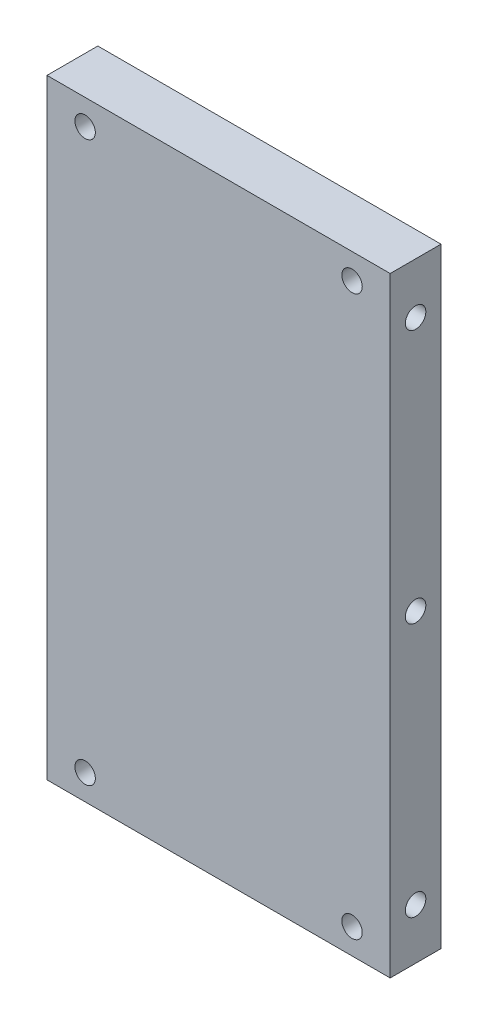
ISO-10303-21;
HEADER;
FILE_DESCRIPTION(('STEP AP214'),'2;1');
FILE_NAME('part.step','',(''),(''),'','','');
FILE_SCHEMA(('AUTOMOTIVE_DESIGN { 1 0 10303 214 1 1 1 1 }'));
ENDSEC;
DATA;
#1=APPLICATION_CONTEXT('core data for automotive mechanical design processes');
#2=APPLICATION_PROTOCOL_DEFINITION('international standard','automotive_design',2000,#1);
#3=PRODUCT_CONTEXT('',#1,'mechanical');
#4=PRODUCT('Part','Part','',(#3));
#5=PRODUCT_RELATED_PRODUCT_CATEGORY('part','',(#4));
#6=PRODUCT_DEFINITION_FORMATION('','',#4);
#7=PRODUCT_DEFINITION_CONTEXT('part definition',#1,'design');
#8=PRODUCT_DEFINITION('design','',#6,#7);
#9=PRODUCT_DEFINITION_SHAPE('','',#8);
#10=(LENGTH_UNIT() NAMED_UNIT(*) SI_UNIT(.MILLI.,.METRE.));
#11=(NAMED_UNIT(*) PLANE_ANGLE_UNIT() SI_UNIT($,.RADIAN.));
#12=(NAMED_UNIT(*) SI_UNIT($,.STERADIAN.) SOLID_ANGLE_UNIT());
#13=UNCERTAINTY_MEASURE_WITH_UNIT(LENGTH_MEASURE(1.E-05),#10,'distance_accuracy_value','');
#14=(GEOMETRIC_REPRESENTATION_CONTEXT(3) GLOBAL_UNCERTAINTY_ASSIGNED_CONTEXT((#13)) GLOBAL_UNIT_ASSIGNED_CONTEXT((#10,
#11,#12)) REPRESENTATION_CONTEXT('',''));
#15=CARTESIAN_POINT('',(0.,0.,0.));
#16=DIRECTION('',(0.,0.,1.));
#17=DIRECTION('',(1.,0.,0.));
#18=AXIS2_PLACEMENT_3D('',#15,#16,#17);
#19=CARTESIAN_POINT('',(0.,152.4,0.));
#20=DIRECTION('',(0.,0.,-1.));
#21=DIRECTION('',(-1.,0.,0.));
#22=AXIS2_PLACEMENT_3D('',#19,#20,#21);
#23=PLANE('',#22);
#24=CARTESIAN_POINT('',(9.525,6.34999999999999,0.));
#25=DIRECTION('',(0.,0.,1.));
#26=DIRECTION('',(1.,0.,0.));
#27=AXIS2_PLACEMENT_3D('',#24,#25,#26);
#28=CIRCLE('',#27,2.5527);
#29=CARTESIAN_POINT('',(12.0777,6.34999999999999,0.));
#30=VERTEX_POINT('',#29);
#31=EDGE_CURVE('E139',#30,#30,#28,.T.);
#32=ORIENTED_EDGE('',*,*,#31,.T.);
#33=EDGE_LOOP('',(#32));
#34=FACE_BOUND('',#33,.T.);
#35=CARTESIAN_POINT('',(76.2,146.05,0.));
#36=DIRECTION('',(0.,0.,1.));
#37=DIRECTION('',(1.,0.,0.));
#38=AXIS2_PLACEMENT_3D('',#35,#36,#37);
#39=CIRCLE('',#38,2.55269999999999);
#40=CARTESIAN_POINT('',(78.7527,146.05,0.));
#41=VERTEX_POINT('',#40);
#42=EDGE_CURVE('E157',#41,#41,#39,.T.);
#43=ORIENTED_EDGE('',*,*,#42,.T.);
#44=EDGE_LOOP('',(#43));
#45=FACE_BOUND('',#44,.T.);
#46=DIRECTION('',(0.,-1.,0.));
#47=VECTOR('',#46,1.);
#48=CARTESIAN_POINT('',(0.,0.,0.));
#49=LINE('',#48,#47);
#50=CARTESIAN_POINT('',(0.,152.4,0.));
#51=VERTEX_POINT('',#50);
#52=CARTESIAN_POINT('',(0.,0.,0.));
#53=VERTEX_POINT('',#52);
#54=EDGE_CURVE('E163',#51,#53,#49,.T.);
#55=ORIENTED_EDGE('',*,*,#54,.F.);
#56=DIRECTION('',(-1.,0.,0.));
#57=VECTOR('',#56,1.);
#58=CARTESIAN_POINT('',(0.,152.4,0.));
#59=LINE('',#58,#57);
#60=CARTESIAN_POINT('',(85.725,152.4,0.));
#61=VERTEX_POINT('',#60);
#62=EDGE_CURVE('E170',#61,#51,#59,.T.);
#63=ORIENTED_EDGE('',*,*,#62,.F.);
#64=DIRECTION('',(0.,1.,0.));
#65=VECTOR('',#64,1.);
#66=CARTESIAN_POINT('',(85.725,0.,0.));
#67=LINE('',#66,#65);
#68=CARTESIAN_POINT('',(85.725,0.,0.));
#69=VERTEX_POINT('',#68);
#70=EDGE_CURVE('E168',#69,#61,#67,.T.);
#71=ORIENTED_EDGE('',*,*,#70,.F.);
#72=DIRECTION('',(1.,0.,0.));
#73=VECTOR('',#72,1.);
#74=CARTESIAN_POINT('',(0.,0.,0.));
#75=LINE('',#74,#73);
#76=EDGE_CURVE('E166',#53,#69,#75,.T.);
#77=ORIENTED_EDGE('',*,*,#76,.F.);
#78=EDGE_LOOP('',(#55,#63,#71,#77));
#79=FACE_BOUND('',#78,.T.);
#80=CARTESIAN_POINT('',(9.525,146.05,0.));
#81=DIRECTION('',(0.,0.,1.));
#82=DIRECTION('',(1.,0.,0.));
#83=AXIS2_PLACEMENT_3D('',#80,#81,#82);
#84=CIRCLE('',#83,2.5527);
#85=CARTESIAN_POINT('',(12.0777,146.05,0.));
#86=VERTEX_POINT('',#85);
#87=EDGE_CURVE('E151',#86,#86,#84,.T.);
#88=ORIENTED_EDGE('',*,*,#87,.T.);
#89=EDGE_LOOP('',(#88));
#90=FACE_BOUND('',#89,.T.);
#91=CARTESIAN_POINT('',(76.2,6.34999999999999,0.));
#92=DIRECTION('',(0.,0.,1.));
#93=DIRECTION('',(1.,0.,0.));
#94=AXIS2_PLACEMENT_3D('',#91,#92,#93);
#95=CIRCLE('',#94,2.55269999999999);
#96=CARTESIAN_POINT('',(78.7527,6.34999999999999,0.));
#97=VERTEX_POINT('',#96);
#98=EDGE_CURVE('E145',#97,#97,#95,.T.);
#99=ORIENTED_EDGE('',*,*,#98,.T.);
#100=EDGE_LOOP('',(#99));
#101=FACE_BOUND('',#100,.T.);
#102=ADVANCED_FACE('F38',(#34,#45,#79,#90,#101),#23,.T.);
#103=CARTESIAN_POINT('',(0.,0.,12.7));
#104=DIRECTION('',(1.,0.,0.));
#105=DIRECTION('',(0.,0.,-1.));
#106=AXIS2_PLACEMENT_3D('',#103,#104,#105);
#107=PLANE('',#106);
#108=CARTESIAN_POINT('',(0.,139.7,6.35));
#109=DIRECTION('',(-1.,0.,0.));
#110=DIRECTION('',(0.,0.,1.));
#111=AXIS2_PLACEMENT_3D('',#108,#109,#110);
#112=CIRCLE('',#111,2.55269999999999);
#113=CARTESIAN_POINT('',(0.,139.7,8.90269999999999));
#114=VERTEX_POINT('',#113);
#115=EDGE_CURVE('E124',#114,#114,#112,.T.);
#116=ORIENTED_EDGE('',*,*,#115,.F.);
#117=EDGE_LOOP('',(#116));
#118=FACE_BOUND('',#117,.T.);
#119=CARTESIAN_POINT('',(0.,76.2,6.35));
#120=DIRECTION('',(-1.,0.,0.));
#121=DIRECTION('',(0.,0.,1.));
#122=AXIS2_PLACEMENT_3D('',#119,#120,#121);
#123=CIRCLE('',#122,2.55269999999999);
#124=CARTESIAN_POINT('',(0.,76.2,8.90269999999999));
#125=VERTEX_POINT('',#124);
#126=EDGE_CURVE('E130',#125,#125,#123,.T.);
#127=ORIENTED_EDGE('',*,*,#126,.F.);
#128=EDGE_LOOP('',(#127));
#129=FACE_BOUND('',#128,.T.);
#130=CARTESIAN_POINT('',(0.,12.7,6.35));
#131=DIRECTION('',(-1.,0.,0.));
#132=DIRECTION('',(0.,0.,1.));
#133=AXIS2_PLACEMENT_3D('',#130,#131,#132);
#134=CIRCLE('',#133,2.55269999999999);
#135=CARTESIAN_POINT('',(0.,12.7,8.90269999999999));
#136=VERTEX_POINT('',#135);
#137=EDGE_CURVE('E136',#136,#136,#134,.T.);
#138=ORIENTED_EDGE('',*,*,#137,.F.);
#139=EDGE_LOOP('',(#138));
#140=FACE_BOUND('',#139,.T.);
#141=ORIENTED_EDGE('',*,*,#54,.T.);
#142=DIRECTION('',(0.,0.,-1.));
#143=VECTOR('',#142,1.);
#144=CARTESIAN_POINT('',(0.,0.,12.7));
#145=LINE('',#144,#143);
#146=CARTESIAN_POINT('',(0.,0.,12.7));
#147=VERTEX_POINT('',#146);
#148=EDGE_CURVE('E11',#147,#53,#145,.T.);
#149=ORIENTED_EDGE('',*,*,#148,.F.);
#150=DIRECTION('',(0.,-1.,0.));
#151=VECTOR('',#150,1.);
#152=CARTESIAN_POINT('',(0.,0.,12.7));
#153=LINE('',#152,#151);
#154=CARTESIAN_POINT('',(0.,152.4,12.7));
#155=VERTEX_POINT('',#154);
#156=EDGE_CURVE('E172',#155,#147,#153,.T.);
#157=ORIENTED_EDGE('',*,*,#156,.F.);
#158=DIRECTION('',(0.,0.,-1.));
#159=VECTOR('',#158,1.);
#160=CARTESIAN_POINT('',(0.,152.4,12.7));
#161=LINE('',#160,#159);
#162=EDGE_CURVE('E178',#155,#51,#161,.T.);
#163=ORIENTED_EDGE('',*,*,#162,.T.);
#164=EDGE_LOOP('',(#141,#149,#157,#163));
#165=FACE_BOUND('',#164,.T.);
#166=ADVANCED_FACE('F40',(#118,#129,#140,#165),#107,.F.);
#167=CARTESIAN_POINT('',(0.,0.,12.7));
#168=DIRECTION('',(0.,1.,0.));
#169=DIRECTION('',(0.,0.,1.));
#170=AXIS2_PLACEMENT_3D('',#167,#168,#169);
#171=PLANE('',#170);
#172=ORIENTED_EDGE('',*,*,#76,.T.);
#173=DIRECTION('',(0.,0.,-1.));
#174=VECTOR('',#173,1.);
#175=CARTESIAN_POINT('',(85.725,0.,12.7));
#176=LINE('',#175,#174);
#177=CARTESIAN_POINT('',(85.725,0.,12.7));
#178=VERTEX_POINT('',#177);
#179=EDGE_CURVE('E46',#178,#69,#176,.T.);
#180=ORIENTED_EDGE('',*,*,#179,.F.);
#181=DIRECTION('',(1.,0.,0.));
#182=VECTOR('',#181,1.);
#183=CARTESIAN_POINT('',(0.,0.,12.7));
#184=LINE('',#183,#182);
#185=EDGE_CURVE('E174',#147,#178,#184,.T.);
#186=ORIENTED_EDGE('',*,*,#185,.F.);
#187=ORIENTED_EDGE('',*,*,#148,.T.);
#188=EDGE_LOOP('',(#172,#180,#186,#187));
#189=FACE_BOUND('',#188,.T.);
#190=ADVANCED_FACE('F199',(#189),#171,.F.);
#191=CARTESIAN_POINT('',(85.725,0.,12.7));
#192=DIRECTION('',(-1.,0.,0.));
#193=DIRECTION('',(0.,0.,1.));
#194=AXIS2_PLACEMENT_3D('',#191,#192,#193);
#195=PLANE('',#194);
#196=CARTESIAN_POINT('',(85.725,139.7,6.35));
#197=DIRECTION('',(1.,0.,0.));
#198=DIRECTION('',(0.,0.,-1.));
#199=AXIS2_PLACEMENT_3D('',#196,#197,#198);
#200=CIRCLE('',#199,2.55269999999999);
#201=CARTESIAN_POINT('',(85.725,139.7,3.79730000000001));
#202=VERTEX_POINT('',#201);
#203=EDGE_CURVE('E104',#202,#202,#200,.T.);
#204=ORIENTED_EDGE('',*,*,#203,.F.);
#205=EDGE_LOOP('',(#204));
#206=FACE_BOUND('',#205,.T.);
#207=CARTESIAN_POINT('',(85.725,76.2,6.35));
#208=DIRECTION('',(1.,0.,0.));
#209=DIRECTION('',(0.,0.,-1.));
#210=AXIS2_PLACEMENT_3D('',#207,#208,#209);
#211=CIRCLE('',#210,2.55269999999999);
#212=CARTESIAN_POINT('',(85.725,76.2,3.79730000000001));
#213=VERTEX_POINT('',#212);
#214=EDGE_CURVE('E112',#213,#213,#211,.T.);
#215=ORIENTED_EDGE('',*,*,#214,.F.);
#216=EDGE_LOOP('',(#215));
#217=FACE_BOUND('',#216,.T.);
#218=CARTESIAN_POINT('',(85.725,12.7,6.35));
#219=DIRECTION('',(1.,0.,0.));
#220=DIRECTION('',(0.,0.,-1.));
#221=AXIS2_PLACEMENT_3D('',#218,#219,#220);
#222=CIRCLE('',#221,2.55269999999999);
#223=CARTESIAN_POINT('',(85.725,12.7,3.79730000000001));
#224=VERTEX_POINT('',#223);
#225=EDGE_CURVE('E118',#224,#224,#222,.T.);
#226=ORIENTED_EDGE('',*,*,#225,.F.);
#227=EDGE_LOOP('',(#226));
#228=FACE_BOUND('',#227,.T.);
#229=ORIENTED_EDGE('',*,*,#70,.T.);
#230=DIRECTION('',(0.,0.,-1.));
#231=VECTOR('',#230,1.);
#232=CARTESIAN_POINT('',(85.725,152.4,12.7));
#233=LINE('',#232,#231);
#234=CARTESIAN_POINT('',(85.725,152.4,12.7));
#235=VERTEX_POINT('',#234);
#236=EDGE_CURVE('E181',#235,#61,#233,.T.);
#237=ORIENTED_EDGE('',*,*,#236,.F.);
#238=DIRECTION('',(0.,1.,0.));
#239=VECTOR('',#238,1.);
#240=CARTESIAN_POINT('',(85.725,0.,12.7));
#241=LINE('',#240,#239);
#242=EDGE_CURVE('E58',#178,#235,#241,.T.);
#243=ORIENTED_EDGE('',*,*,#242,.F.);
#244=ORIENTED_EDGE('',*,*,#179,.T.);
#245=EDGE_LOOP('',(#229,#237,#243,#244));
#246=FACE_BOUND('',#245,.T.);
#247=ADVANCED_FACE('F187',(#206,#217,#228,#246),#195,.F.);
#248=CARTESIAN_POINT('',(0.,152.4,12.7));
#249=DIRECTION('',(0.,-1.,0.));
#250=DIRECTION('',(0.,0.,-1.));
#251=AXIS2_PLACEMENT_3D('',#248,#249,#250);
#252=PLANE('',#251);
#253=ORIENTED_EDGE('',*,*,#62,.T.);
#254=ORIENTED_EDGE('',*,*,#162,.F.);
#255=DIRECTION('',(-1.,0.,0.));
#256=VECTOR('',#255,1.);
#257=CARTESIAN_POINT('',(0.,152.4,12.7));
#258=LINE('',#257,#256);
#259=EDGE_CURVE('E53',#235,#155,#258,.T.);
#260=ORIENTED_EDGE('',*,*,#259,.F.);
#261=ORIENTED_EDGE('',*,*,#236,.T.);
#262=EDGE_LOOP('',(#253,#254,#260,#261));
#263=FACE_BOUND('',#262,.T.);
#264=ADVANCED_FACE('F194',(#263),#252,.F.);
#265=CARTESIAN_POINT('',(0.,152.4,12.7));
#266=DIRECTION('',(0.,0.,-1.));
#267=DIRECTION('',(-1.,0.,0.));
#268=AXIS2_PLACEMENT_3D('',#265,#266,#267);
#269=PLANE('',#268);
#270=CARTESIAN_POINT('',(9.525,6.34999999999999,12.7));
#271=DIRECTION('',(0.,0.,1.));
#272=DIRECTION('',(1.,0.,0.));
#273=AXIS2_PLACEMENT_3D('',#270,#271,#272);
#274=CIRCLE('',#273,2.55269999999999);
#275=CARTESIAN_POINT('',(12.0777,6.34999999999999,12.7));
#276=VERTEX_POINT('',#275);
#277=EDGE_CURVE('E142',#276,#276,#274,.T.);
#278=ORIENTED_EDGE('',*,*,#277,.F.);
#279=EDGE_LOOP('',(#278));
#280=FACE_BOUND('',#279,.T.);
#281=CARTESIAN_POINT('',(76.2,6.34999999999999,12.7));
#282=DIRECTION('',(0.,0.,1.));
#283=DIRECTION('',(1.,0.,0.));
#284=AXIS2_PLACEMENT_3D('',#281,#282,#283);
#285=CIRCLE('',#284,2.55269999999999);
#286=CARTESIAN_POINT('',(78.7527,6.34999999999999,12.7));
#287=VERTEX_POINT('',#286);
#288=EDGE_CURVE('E148',#287,#287,#285,.T.);
#289=ORIENTED_EDGE('',*,*,#288,.F.);
#290=EDGE_LOOP('',(#289));
#291=FACE_BOUND('',#290,.T.);
#292=CARTESIAN_POINT('',(9.525,146.05,12.7));
#293=DIRECTION('',(0.,0.,1.));
#294=DIRECTION('',(1.,0.,0.));
#295=AXIS2_PLACEMENT_3D('',#292,#293,#294);
#296=CIRCLE('',#295,2.55269999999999);
#297=CARTESIAN_POINT('',(12.0777,146.05,12.7));
#298=VERTEX_POINT('',#297);
#299=EDGE_CURVE('E154',#298,#298,#296,.T.);
#300=ORIENTED_EDGE('',*,*,#299,.F.);
#301=EDGE_LOOP('',(#300));
#302=FACE_BOUND('',#301,.T.);
#303=CARTESIAN_POINT('',(76.2,146.05,12.7));
#304=DIRECTION('',(0.,0.,1.));
#305=DIRECTION('',(1.,0.,0.));
#306=AXIS2_PLACEMENT_3D('',#303,#304,#305);
#307=CIRCLE('',#306,2.55269999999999);
#308=CARTESIAN_POINT('',(78.7527,146.05,12.7));
#309=VERTEX_POINT('',#308);
#310=EDGE_CURVE('E160',#309,#309,#307,.T.);
#311=ORIENTED_EDGE('',*,*,#310,.F.);
#312=EDGE_LOOP('',(#311));
#313=FACE_BOUND('',#312,.T.);
#314=ORIENTED_EDGE('',*,*,#156,.T.);
#315=ORIENTED_EDGE('',*,*,#185,.T.);
#316=ORIENTED_EDGE('',*,*,#242,.T.);
#317=ORIENTED_EDGE('',*,*,#259,.T.);
#318=EDGE_LOOP('',(#314,#315,#316,#317));
#319=FACE_BOUND('',#318,.T.);
#320=ADVANCED_FACE('F198',(#280,#291,#302,#313,#319),#269,.F.);
#321=CARTESIAN_POINT('',(76.2,146.05,12.7));
#322=DIRECTION('',(0.,0.,1.));
#323=DIRECTION('',(1.,0.,0.));
#324=AXIS2_PLACEMENT_3D('',#321,#322,#323);
#325=CYLINDRICAL_SURFACE('',#324,2.55269999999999);
#326=ORIENTED_EDGE('',*,*,#42,.F.);
#327=EDGE_LOOP('',(#326));
#328=FACE_BOUND('',#327,.T.);
#329=ORIENTED_EDGE('',*,*,#310,.T.);
#330=EDGE_LOOP('',(#329));
#331=FACE_BOUND('',#330,.T.);
#332=ADVANCED_FACE('F216',(#328,#331),#325,.F.);
#333=CARTESIAN_POINT('',(9.525,146.05,12.7));
#334=DIRECTION('',(0.,0.,1.));
#335=DIRECTION('',(1.,0.,0.));
#336=AXIS2_PLACEMENT_3D('',#333,#334,#335);
#337=CYLINDRICAL_SURFACE('',#336,2.55269999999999);
#338=ORIENTED_EDGE('',*,*,#87,.F.);
#339=EDGE_LOOP('',(#338));
#340=FACE_BOUND('',#339,.T.);
#341=ORIENTED_EDGE('',*,*,#299,.T.);
#342=EDGE_LOOP('',(#341));
#343=FACE_BOUND('',#342,.T.);
#344=ADVANCED_FACE('F237',(#340,#343),#337,.F.);
#345=CARTESIAN_POINT('',(76.2,6.34999999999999,12.7));
#346=DIRECTION('',(0.,0.,1.));
#347=DIRECTION('',(1.,0.,0.));
#348=AXIS2_PLACEMENT_3D('',#345,#346,#347);
#349=CYLINDRICAL_SURFACE('',#348,2.55269999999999);
#350=ORIENTED_EDGE('',*,*,#98,.F.);
#351=EDGE_LOOP('',(#350));
#352=FACE_BOUND('',#351,.T.);
#353=ORIENTED_EDGE('',*,*,#288,.T.);
#354=EDGE_LOOP('',(#353));
#355=FACE_BOUND('',#354,.T.);
#356=ADVANCED_FACE('F244',(#352,#355),#349,.F.);
#357=CARTESIAN_POINT('',(9.525,6.34999999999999,12.7));
#358=DIRECTION('',(0.,0.,1.));
#359=DIRECTION('',(1.,0.,0.));
#360=AXIS2_PLACEMENT_3D('',#357,#358,#359);
#361=CYLINDRICAL_SURFACE('',#360,2.55269999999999);
#362=ORIENTED_EDGE('',*,*,#31,.F.);
#363=EDGE_LOOP('',(#362));
#364=FACE_BOUND('',#363,.T.);
#365=ORIENTED_EDGE('',*,*,#277,.T.);
#366=EDGE_LOOP('',(#365));
#367=FACE_BOUND('',#366,.T.);
#368=ADVANCED_FACE('F251',(#364,#367),#361,.F.);
#369=CARTESIAN_POINT('',(0.,12.7,6.35));
#370=DIRECTION('',(-1.,0.,0.));
#371=DIRECTION('',(0.,0.,1.));
#372=AXIS2_PLACEMENT_3D('',#369,#370,#371);
#373=CYLINDRICAL_SURFACE('',#372,2.55269999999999);
#374=CARTESIAN_POINT('',(21.59,12.7,6.35));
#375=DIRECTION('',(-1.,0.,0.));
#376=DIRECTION('',(0.,0.,1.));
#377=AXIS2_PLACEMENT_3D('',#374,#375,#376);
#378=CIRCLE('',#377,2.55269999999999);
#379=CARTESIAN_POINT('',(21.59,12.7,8.90269999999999));
#380=VERTEX_POINT('',#379);
#381=EDGE_CURVE('E133',#380,#380,#378,.T.);
#382=ORIENTED_EDGE('',*,*,#381,.F.);
#383=EDGE_LOOP('',(#382));
#384=FACE_BOUND('',#383,.T.);
#385=ORIENTED_EDGE('',*,*,#137,.T.);
#386=EDGE_LOOP('',(#385));
#387=FACE_BOUND('',#386,.T.);
#388=ADVANCED_FACE('F259',(#384,#387),#373,.F.);
#389=CARTESIAN_POINT('',(21.59,12.7,6.35));
#390=DIRECTION('',(-1.,0.,0.));
#391=DIRECTION('',(0.,0.,1.));
#392=AXIS2_PLACEMENT_3D('',#389,#390,#391);
#393=CONICAL_SURFACE('',#392,2.55269999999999,1.02974425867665);
#394=CARTESIAN_POINT('',(23.1238169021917,12.7,6.35));
#395=VERTEX_POINT('',#394);
#396=VERTEX_LOOP('',#395);
#397=FACE_BOUND('',#396,.T.);
#398=ORIENTED_EDGE('',*,*,#381,.T.);
#399=EDGE_LOOP('',(#398));
#400=FACE_BOUND('',#399,.T.);
#401=ADVANCED_FACE('F268',(#397,#400),#393,.F.);
#402=CARTESIAN_POINT('',(0.,76.2,6.35));
#403=DIRECTION('',(-1.,0.,0.));
#404=DIRECTION('',(0.,0.,1.));
#405=AXIS2_PLACEMENT_3D('',#402,#403,#404);
#406=CYLINDRICAL_SURFACE('',#405,2.55269999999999);
#407=CARTESIAN_POINT('',(21.59,76.2,6.35));
#408=DIRECTION('',(-1.,0.,0.));
#409=DIRECTION('',(0.,0.,1.));
#410=AXIS2_PLACEMENT_3D('',#407,#408,#409);
#411=CIRCLE('',#410,2.55269999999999);
#412=CARTESIAN_POINT('',(21.59,76.2,8.90269999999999));
#413=VERTEX_POINT('',#412);
#414=EDGE_CURVE('E127',#413,#413,#411,.T.);
#415=ORIENTED_EDGE('',*,*,#414,.F.);
#416=EDGE_LOOP('',(#415));
#417=FACE_BOUND('',#416,.T.);
#418=ORIENTED_EDGE('',*,*,#126,.T.);
#419=EDGE_LOOP('',(#418));
#420=FACE_BOUND('',#419,.T.);
#421=ADVANCED_FACE('F276',(#417,#420),#406,.F.);
#422=CARTESIAN_POINT('',(21.59,76.2,6.35));
#423=DIRECTION('',(-1.,0.,0.));
#424=DIRECTION('',(0.,0.,1.));
#425=AXIS2_PLACEMENT_3D('',#422,#423,#424);
#426=CONICAL_SURFACE('',#425,2.55269999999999,1.02974425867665);
#427=CARTESIAN_POINT('',(23.1238169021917,76.2,6.35));
#428=VERTEX_POINT('',#427);
#429=VERTEX_LOOP('',#428);
#430=FACE_BOUND('',#429,.T.);
#431=ORIENTED_EDGE('',*,*,#414,.T.);
#432=EDGE_LOOP('',(#431));
#433=FACE_BOUND('',#432,.T.);
#434=ADVANCED_FACE('F286',(#430,#433),#426,.F.);
#435=CARTESIAN_POINT('',(0.,139.7,6.35));
#436=DIRECTION('',(-1.,0.,0.));
#437=DIRECTION('',(0.,0.,1.));
#438=AXIS2_PLACEMENT_3D('',#435,#436,#437);
#439=CYLINDRICAL_SURFACE('',#438,2.55269999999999);
#440=CARTESIAN_POINT('',(21.59,139.7,6.35));
#441=DIRECTION('',(-1.,0.,0.));
#442=DIRECTION('',(0.,0.,1.));
#443=AXIS2_PLACEMENT_3D('',#440,#441,#442);
#444=CIRCLE('',#443,2.55269999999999);
#445=CARTESIAN_POINT('',(21.59,139.7,8.90269999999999));
#446=VERTEX_POINT('',#445);
#447=EDGE_CURVE('E121',#446,#446,#444,.T.);
#448=ORIENTED_EDGE('',*,*,#447,.F.);
#449=EDGE_LOOP('',(#448));
#450=FACE_BOUND('',#449,.T.);
#451=ORIENTED_EDGE('',*,*,#115,.T.);
#452=EDGE_LOOP('',(#451));
#453=FACE_BOUND('',#452,.T.);
#454=ADVANCED_FACE('F295',(#450,#453),#439,.F.);
#455=CARTESIAN_POINT('',(21.59,139.7,6.35));
#456=DIRECTION('',(-1.,0.,0.));
#457=DIRECTION('',(0.,0.,1.));
#458=AXIS2_PLACEMENT_3D('',#455,#456,#457);
#459=CONICAL_SURFACE('',#458,2.55269999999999,1.02974425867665);
#460=CARTESIAN_POINT('',(23.1238169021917,139.7,6.35));
#461=VERTEX_POINT('',#460);
#462=VERTEX_LOOP('',#461);
#463=FACE_BOUND('',#462,.T.);
#464=ORIENTED_EDGE('',*,*,#447,.T.);
#465=EDGE_LOOP('',(#464));
#466=FACE_BOUND('',#465,.T.);
#467=ADVANCED_FACE('F304',(#463,#466),#459,.F.);
#468=CARTESIAN_POINT('',(85.725,12.7,6.35));
#469=DIRECTION('',(1.,0.,0.));
#470=DIRECTION('',(0.,0.,-1.));
#471=AXIS2_PLACEMENT_3D('',#468,#469,#470);
#472=CYLINDRICAL_SURFACE('',#471,2.55269999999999);
#473=CARTESIAN_POINT('',(64.135,12.7,6.35));
#474=DIRECTION('',(1.,0.,0.));
#475=DIRECTION('',(0.,0.,-1.));
#476=AXIS2_PLACEMENT_3D('',#473,#474,#475);
#477=CIRCLE('',#476,2.55269999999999);
#478=CARTESIAN_POINT('',(64.135,12.7,3.79730000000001));
#479=VERTEX_POINT('',#478);
#480=EDGE_CURVE('E115',#479,#479,#477,.T.);
#481=ORIENTED_EDGE('',*,*,#480,.F.);
#482=EDGE_LOOP('',(#481));
#483=FACE_BOUND('',#482,.T.);
#484=ORIENTED_EDGE('',*,*,#225,.T.);
#485=EDGE_LOOP('',(#484));
#486=FACE_BOUND('',#485,.T.);
#487=ADVANCED_FACE('F313',(#483,#486),#472,.F.);
#488=CARTESIAN_POINT('',(64.135,12.7,6.35));
#489=DIRECTION('',(1.,0.,0.));
#490=DIRECTION('',(0.,0.,-1.));
#491=AXIS2_PLACEMENT_3D('',#488,#489,#490);
#492=CONICAL_SURFACE('',#491,2.55269999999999,1.02974425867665);
#493=CARTESIAN_POINT('',(62.6011830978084,12.7,6.35));
#494=VERTEX_POINT('',#493);
#495=VERTEX_LOOP('',#494);
#496=FACE_BOUND('',#495,.T.);
#497=ORIENTED_EDGE('',*,*,#480,.T.);
#498=EDGE_LOOP('',(#497));
#499=FACE_BOUND('',#498,.T.);
#500=ADVANCED_FACE('F320',(#496,#499),#492,.F.);
#501=CARTESIAN_POINT('',(85.725,76.2,6.35));
#502=DIRECTION('',(1.,0.,0.));
#503=DIRECTION('',(0.,0.,-1.));
#504=AXIS2_PLACEMENT_3D('',#501,#502,#503);
#505=CYLINDRICAL_SURFACE('',#504,2.55269999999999);
#506=CARTESIAN_POINT('',(64.135,76.2,6.35));
#507=DIRECTION('',(1.,0.,0.));
#508=DIRECTION('',(0.,0.,-1.));
#509=AXIS2_PLACEMENT_3D('',#506,#507,#508);
#510=CIRCLE('',#509,2.55269999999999);
#511=CARTESIAN_POINT('',(64.135,76.2,3.79730000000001));
#512=VERTEX_POINT('',#511);
#513=EDGE_CURVE('E107',#512,#512,#510,.T.);
#514=ORIENTED_EDGE('',*,*,#513,.F.);
#515=EDGE_LOOP('',(#514));
#516=FACE_BOUND('',#515,.T.);
#517=ORIENTED_EDGE('',*,*,#214,.T.);
#518=EDGE_LOOP('',(#517));
#519=FACE_BOUND('',#518,.T.);
#520=ADVANCED_FACE('F328',(#516,#519),#505,.F.);
#521=CARTESIAN_POINT('',(64.135,76.2,6.35));
#522=DIRECTION('',(1.,0.,0.));
#523=DIRECTION('',(0.,0.,-1.));
#524=AXIS2_PLACEMENT_3D('',#521,#522,#523);
#525=CONICAL_SURFACE('',#524,2.55269999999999,1.02974425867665);
#526=CARTESIAN_POINT('',(62.6011830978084,76.2,6.35));
#527=VERTEX_POINT('',#526);
#528=VERTEX_LOOP('',#527);
#529=FACE_BOUND('',#528,.T.);
#530=ORIENTED_EDGE('',*,*,#513,.T.);
#531=EDGE_LOOP('',(#530));
#532=FACE_BOUND('',#531,.T.);
#533=ADVANCED_FACE('F337',(#529,#532),#525,.F.);
#534=CARTESIAN_POINT('',(85.725,139.7,6.35));
#535=DIRECTION('',(1.,0.,0.));
#536=DIRECTION('',(0.,0.,-1.));
#537=AXIS2_PLACEMENT_3D('',#534,#535,#536);
#538=CYLINDRICAL_SURFACE('',#537,2.55269999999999);
#539=CARTESIAN_POINT('',(64.135,139.7,6.35));
#540=DIRECTION('',(1.,0.,0.));
#541=DIRECTION('',(0.,0.,-1.));
#542=AXIS2_PLACEMENT_3D('',#539,#540,#541);
#543=CIRCLE('',#542,2.55269999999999);
#544=CARTESIAN_POINT('',(64.135,139.7,3.79730000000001));
#545=VERTEX_POINT('',#544);
#546=EDGE_CURVE('E102',#545,#545,#543,.T.);
#547=ORIENTED_EDGE('',*,*,#546,.F.);
#548=EDGE_LOOP('',(#547));
#549=FACE_BOUND('',#548,.T.);
#550=ORIENTED_EDGE('',*,*,#203,.T.);
#551=EDGE_LOOP('',(#550));
#552=FACE_BOUND('',#551,.T.);
#553=ADVANCED_FACE('F98',(#549,#552),#538,.F.);
#554=CARTESIAN_POINT('',(64.135,139.7,6.35));
#555=DIRECTION('',(1.,0.,0.));
#556=DIRECTION('',(0.,0.,-1.));
#557=AXIS2_PLACEMENT_3D('',#554,#555,#556);
#558=CONICAL_SURFACE('',#557,2.55269999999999,1.02974425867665);
#559=CARTESIAN_POINT('',(62.6011830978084,139.7,6.35));
#560=VERTEX_POINT('',#559);
#561=VERTEX_LOOP('',#560);
#562=FACE_BOUND('',#561,.T.);
#563=ORIENTED_EDGE('',*,*,#546,.T.);
#564=EDGE_LOOP('',(#563));
#565=FACE_BOUND('',#564,.T.);
#566=ADVANCED_FACE('F95',(#562,#565),#558,.F.);
#567=CLOSED_SHELL('',(#102,#166,#190,#247,#264,#320,#332,#344,#356,#368,#388,#401,#421,#434,
#454,#467,#487,#500,#520,#533,#553,#566));
#568=MANIFOLD_SOLID_BREP('B2',#567);
#569=ADVANCED_BREP_SHAPE_REPRESENTATION('',(#18,#568),#14);
#570=SHAPE_DEFINITION_REPRESENTATION(#9,#569);
ENDSEC;
END-ISO-10303-21;
